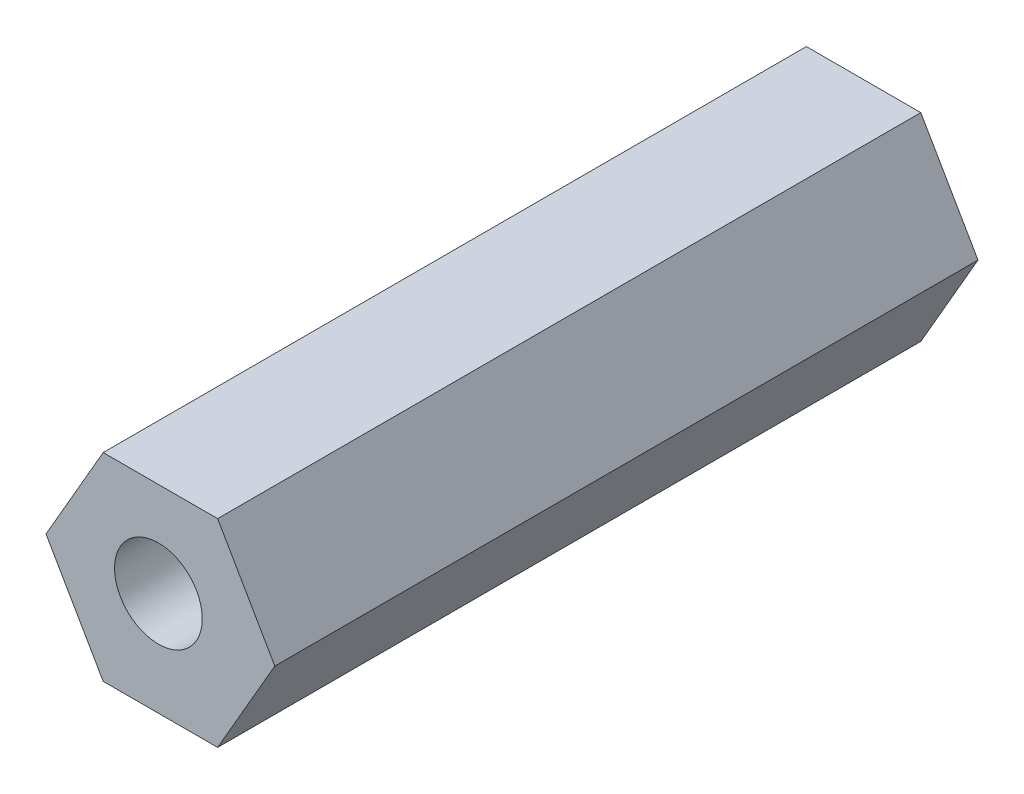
from build123d import *

# Parameters (mm, degrees)
BOSS_EXTRUDE1_DEPTH = 67.6


with BuildPart() as part:
    # Sketch1 → Boss-Extrude1 (new body)
    with BuildSketch(Plane.XY):
        Polygon((5.499261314, 9.525), (-5.499261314, 9.525), (-10.998522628, 0), (-5.499261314, -9.525), (5.499261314, -9.525), (10.998522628, 0), align=None)
    extrude(amount=BOSS_EXTRUDE1_DEPTH)

    # Sketch2 → 3_8-24 Tapped Hole1 (revolve, cut)
    with BuildSketch(Plane(origin=(-0.194451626, 0.44332093, 67.6), x_dir=(0, -1, 0), z_dir=(1, 0, 0))):
        Polygon((0, 0), (0, 67.6), (4.8514, 67.6), (4.2164, 66.965), (4.2164, 0), align=None)
    revolve(axis=Axis((-0.194451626, 0.44332093, 73.95), (0, 0, -1)), mode=Mode.SUBTRACT)


solid = part.part
